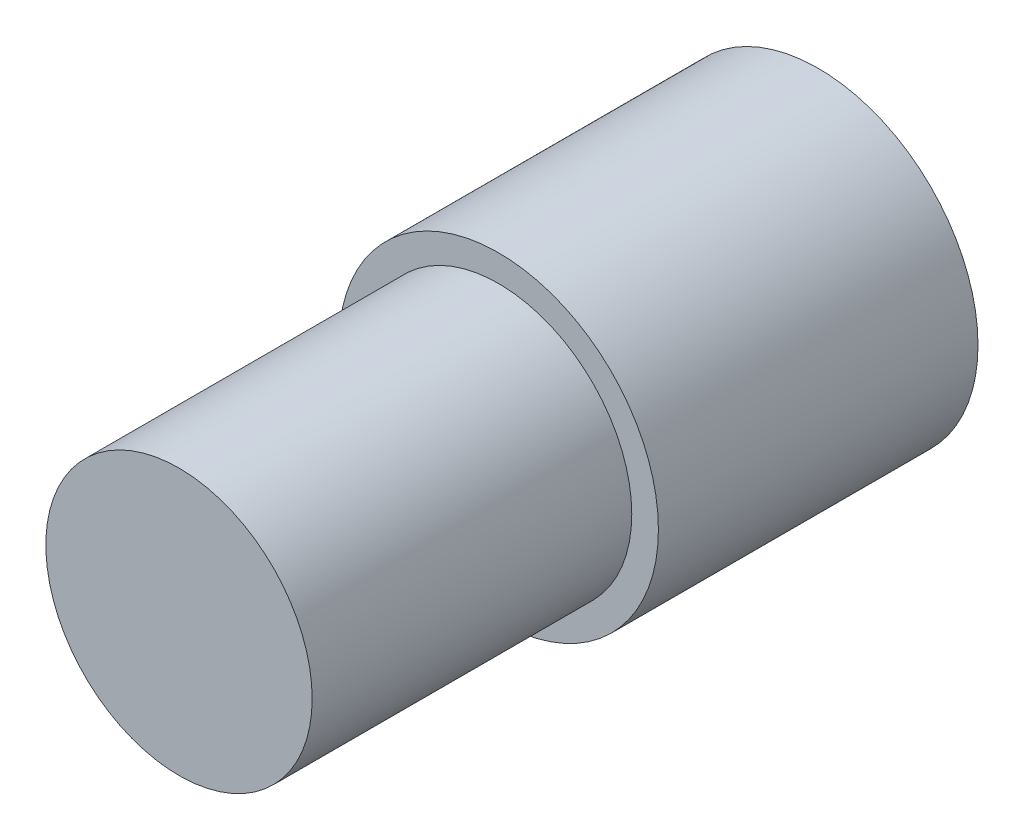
ISO-10303-21;
HEADER;
FILE_DESCRIPTION(('STEP AP214'),'2;1');
FILE_NAME('part.step','',(''),(''),'','','');
FILE_SCHEMA(('AUTOMOTIVE_DESIGN { 1 0 10303 214 1 1 1 1 }'));
ENDSEC;
DATA;
#1=APPLICATION_CONTEXT('core data for automotive mechanical design processes');
#2=APPLICATION_PROTOCOL_DEFINITION('international standard','automotive_design',2000,#1);
#3=PRODUCT_CONTEXT('',#1,'mechanical');
#4=PRODUCT('Part','Part','',(#3));
#5=PRODUCT_RELATED_PRODUCT_CATEGORY('part','',(#4));
#6=PRODUCT_DEFINITION_FORMATION('','',#4);
#7=PRODUCT_DEFINITION_CONTEXT('part definition',#1,'design');
#8=PRODUCT_DEFINITION('design','',#6,#7);
#9=PRODUCT_DEFINITION_SHAPE('','',#8);
#10=(LENGTH_UNIT() NAMED_UNIT(*) SI_UNIT(.MILLI.,.METRE.));
#11=(NAMED_UNIT(*) PLANE_ANGLE_UNIT() SI_UNIT($,.RADIAN.));
#12=(NAMED_UNIT(*) SI_UNIT($,.STERADIAN.) SOLID_ANGLE_UNIT());
#13=UNCERTAINTY_MEASURE_WITH_UNIT(LENGTH_MEASURE(1.E-05),#10,'distance_accuracy_value','');
#14=(GEOMETRIC_REPRESENTATION_CONTEXT(3) GLOBAL_UNCERTAINTY_ASSIGNED_CONTEXT((#13)) GLOBAL_UNIT_ASSIGNED_CONTEXT((#10,
#11,#12)) REPRESENTATION_CONTEXT('',''));
#15=CARTESIAN_POINT('',(0.,0.,0.));
#16=DIRECTION('',(0.,0.,1.));
#17=DIRECTION('',(1.,0.,0.));
#18=AXIS2_PLACEMENT_3D('',#15,#16,#17);
#19=CARTESIAN_POINT('',(0.,0.,12.));
#20=DIRECTION('',(0.,0.,-1.));
#21=DIRECTION('',(-1.,0.,0.));
#22=AXIS2_PLACEMENT_3D('',#19,#20,#21);
#23=CYLINDRICAL_SURFACE('',#22,6.);
#24=CARTESIAN_POINT('',(0.,0.,12.));
#25=DIRECTION('',(0.,0.,1.));
#26=DIRECTION('',(1.,0.,0.));
#27=AXIS2_PLACEMENT_3D('',#24,#25,#26);
#28=CIRCLE('',#27,6.);
#29=CARTESIAN_POINT('',(6.,0.,12.));
#30=VERTEX_POINT('',#29);
#31=EDGE_CURVE('E38',#30,#30,#28,.T.);
#32=ORIENTED_EDGE('',*,*,#31,.F.);
#33=EDGE_LOOP('',(#32));
#34=FACE_BOUND('',#33,.T.);
#35=CARTESIAN_POINT('',(0.,0.,0.));
#36=DIRECTION('',(0.,0.,1.));
#37=DIRECTION('',(1.,0.,0.));
#38=AXIS2_PLACEMENT_3D('',#35,#36,#37);
#39=CIRCLE('',#38,6.);
#40=CARTESIAN_POINT('',(6.,0.,0.));
#41=VERTEX_POINT('',#40);
#42=EDGE_CURVE('E34',#41,#41,#39,.T.);
#43=ORIENTED_EDGE('',*,*,#42,.T.);
#44=EDGE_LOOP('',(#43));
#45=FACE_BOUND('',#44,.T.);
#46=ADVANCED_FACE('F31',(#34,#45),#23,.T.);
#47=CARTESIAN_POINT('',(0.,0.,12.));
#48=DIRECTION('',(0.,0.,1.));
#49=DIRECTION('',(1.,0.,0.));
#50=AXIS2_PLACEMENT_3D('',#47,#48,#49);
#51=PLANE('',#50);
#52=CARTESIAN_POINT('',(0.,0.,12.));
#53=DIRECTION('',(0.,0.,1.));
#54=DIRECTION('',(1.,0.,0.));
#55=AXIS2_PLACEMENT_3D('',#52,#53,#54);
#56=CIRCLE('',#55,5.);
#57=CARTESIAN_POINT('',(5.,0.,12.));
#58=VERTEX_POINT('',#57);
#59=EDGE_CURVE('E10',#58,#58,#56,.T.);
#60=ORIENTED_EDGE('',*,*,#59,.F.);
#61=EDGE_LOOP('',(#60));
#62=FACE_BOUND('',#61,.T.);
#63=ORIENTED_EDGE('',*,*,#31,.T.);
#64=EDGE_LOOP('',(#63));
#65=FACE_BOUND('',#64,.T.);
#66=ADVANCED_FACE('F55',(#62,#65),#51,.T.);
#67=CARTESIAN_POINT('',(0.,0.,0.));
#68=DIRECTION('',(0.,0.,1.));
#69=DIRECTION('',(1.,0.,0.));
#70=AXIS2_PLACEMENT_3D('',#67,#68,#69);
#71=PLANE('',#70);
#72=ORIENTED_EDGE('',*,*,#42,.F.);
#73=EDGE_LOOP('',(#72));
#74=FACE_BOUND('',#73,.T.);
#75=ADVANCED_FACE('F52',(#74),#71,.F.);
#76=CARTESIAN_POINT('',(0.,0.,24.));
#77=DIRECTION('',(0.,0.,-1.));
#78=DIRECTION('',(-1.,0.,0.));
#79=AXIS2_PLACEMENT_3D('',#76,#77,#78);
#80=CYLINDRICAL_SURFACE('',#79,5.);
#81=CARTESIAN_POINT('',(0.,0.,24.));
#82=DIRECTION('',(0.,0.,1.));
#83=DIRECTION('',(1.,0.,0.));
#84=AXIS2_PLACEMENT_3D('',#81,#82,#83);
#85=CIRCLE('',#84,5.);
#86=CARTESIAN_POINT('',(5.,0.,24.));
#87=VERTEX_POINT('',#86);
#88=EDGE_CURVE('E44',#87,#87,#85,.T.);
#89=ORIENTED_EDGE('',*,*,#88,.F.);
#90=EDGE_LOOP('',(#89));
#91=FACE_BOUND('',#90,.T.);
#92=ORIENTED_EDGE('',*,*,#59,.T.);
#93=EDGE_LOOP('',(#92));
#94=FACE_BOUND('',#93,.T.);
#95=ADVANCED_FACE('F54',(#91,#94),#80,.T.);
#96=CARTESIAN_POINT('',(0.,0.,24.));
#97=DIRECTION('',(0.,0.,1.));
#98=DIRECTION('',(1.,0.,0.));
#99=AXIS2_PLACEMENT_3D('',#96,#97,#98);
#100=PLANE('',#99);
#101=ORIENTED_EDGE('',*,*,#88,.T.);
#102=EDGE_LOOP('',(#101));
#103=FACE_BOUND('',#102,.T.);
#104=ADVANCED_FACE('F60',(#103),#100,.T.);
#105=CLOSED_SHELL('',(#46,#66,#75,#95,#104));
#106=MANIFOLD_SOLID_BREP('B2',#105);
#107=ADVANCED_BREP_SHAPE_REPRESENTATION('',(#18,#106),#14);
#108=SHAPE_DEFINITION_REPRESENTATION(#9,#107);
ENDSEC;
END-ISO-10303-21;
